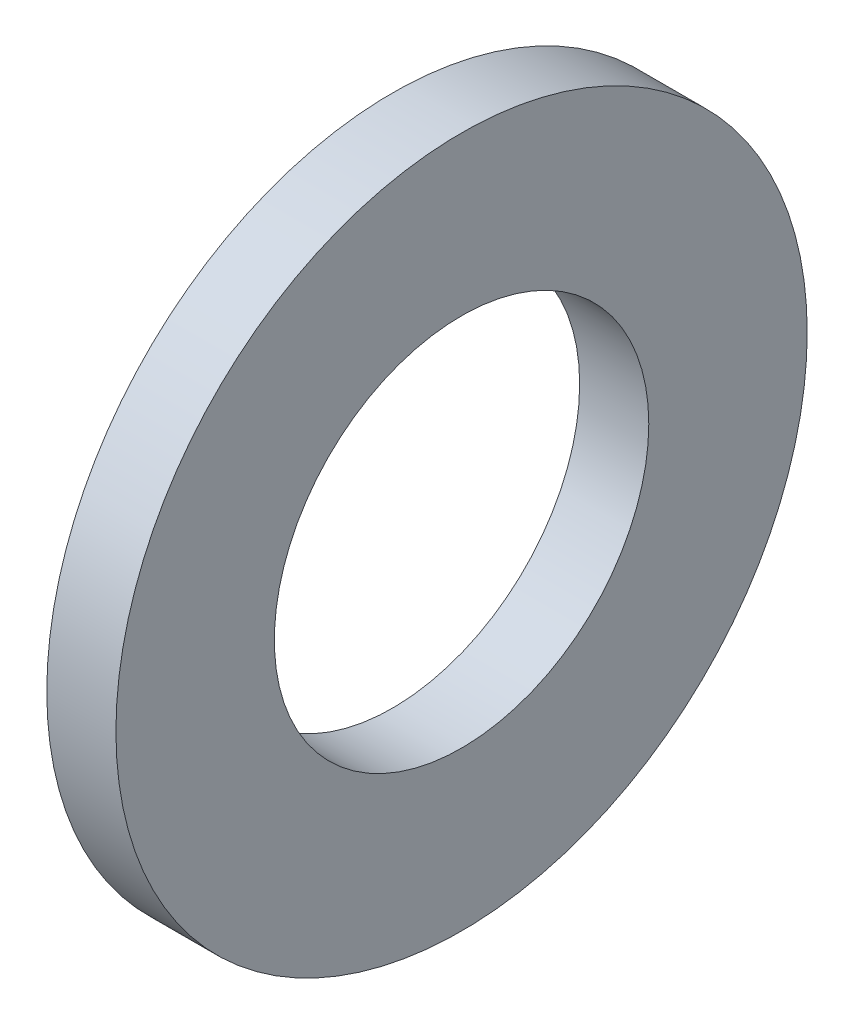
from build123d import *

# Parameters (mm, degrees)
ESQUISSE1_R             = 6
BASE_EXTRUSION_DEPTH    = 1.2
ESQUISSE2_R             = 3.25
ENL_V_MAT_EXTRU_1_DEPTH = 9.569714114


with BuildPart() as part:
    # Esquisse1 → Base-Extrusion (new body)
    with BuildSketch(Plane(origin=(0, 0, 0), x_dir=(0, 0, -1), z_dir=(1, 0, 0))):
        Circle(ESQUISSE1_R)
    extrude(amount=BASE_EXTRUSION_DEPTH)

    # Esquisse2 → Enl_v. mat.-Extru.1 (cut, through all)
    with BuildSketch(Plane(origin=(1.2, 0, 0), x_dir=(0, 0, -1), z_dir=(1, 0, 0))):
        Circle(ESQUISSE2_R)
    extrude(amount=-ENL_V_MAT_EXTRU_1_DEPTH, mode=Mode.SUBTRACT)


solid = part.part
